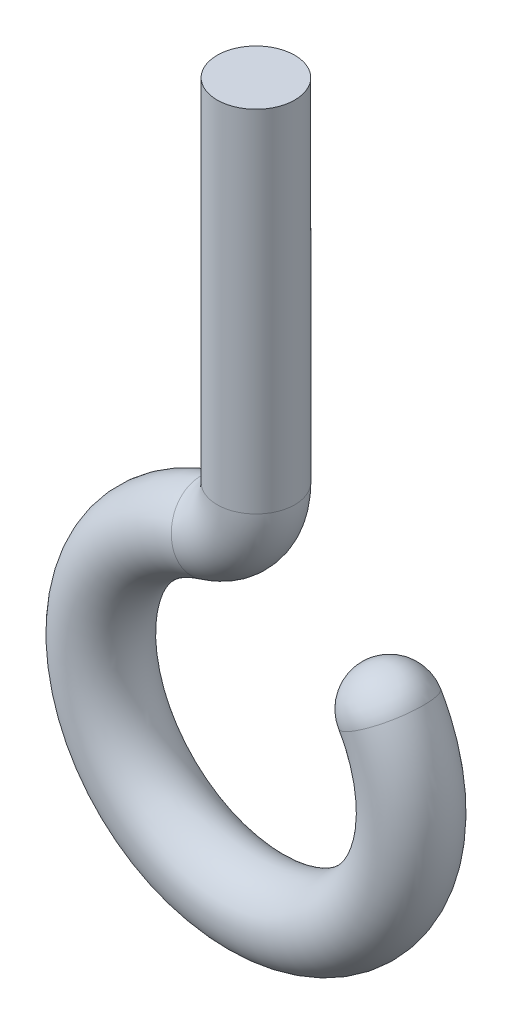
ISO-10303-21;
HEADER;
FILE_DESCRIPTION(('STEP AP214'),'2;1');
FILE_NAME('part.step','',(''),(''),'','','');
FILE_SCHEMA(('AUTOMOTIVE_DESIGN { 1 0 10303 214 1 1 1 1 }'));
ENDSEC;
DATA;
#1=APPLICATION_CONTEXT('core data for automotive mechanical design processes');
#2=APPLICATION_PROTOCOL_DEFINITION('international standard','automotive_design',2000,#1);
#3=PRODUCT_CONTEXT('',#1,'mechanical');
#4=PRODUCT('Part','Part','',(#3));
#5=PRODUCT_RELATED_PRODUCT_CATEGORY('part','',(#4));
#6=PRODUCT_DEFINITION_FORMATION('','',#4);
#7=PRODUCT_DEFINITION_CONTEXT('part definition',#1,'design');
#8=PRODUCT_DEFINITION('design','',#6,#7);
#9=PRODUCT_DEFINITION_SHAPE('','',#8);
#10=(LENGTH_UNIT() NAMED_UNIT(*) SI_UNIT(.MILLI.,.METRE.));
#11=(NAMED_UNIT(*) PLANE_ANGLE_UNIT() SI_UNIT($,.RADIAN.));
#12=(NAMED_UNIT(*) SI_UNIT($,.STERADIAN.) SOLID_ANGLE_UNIT());
#13=UNCERTAINTY_MEASURE_WITH_UNIT(LENGTH_MEASURE(1.E-05),#10,'distance_accuracy_value','');
#14=(GEOMETRIC_REPRESENTATION_CONTEXT(3) GLOBAL_UNCERTAINTY_ASSIGNED_CONTEXT((#13)) GLOBAL_UNIT_ASSIGNED_CONTEXT((#10,
#11,#12)) REPRESENTATION_CONTEXT('',''));
#15=CARTESIAN_POINT('',(0.,0.,0.));
#16=DIRECTION('',(0.,0.,1.));
#17=DIRECTION('',(1.,0.,0.));
#18=AXIS2_PLACEMENT_3D('',#15,#16,#17);
#19=CARTESIAN_POINT('',(0.,-28.,0.));
#20=DIRECTION('',(0.,1.,0.));
#21=DIRECTION('',(-1.,0.,0.));
#22=AXIS2_PLACEMENT_3D('',#19,#20,#21);
#23=PLANE('',#22);
#24=CARTESIAN_POINT('',(0.,-28.,0.));
#25=DIRECTION('',(0.,1.,0.));
#26=DIRECTION('',(-1.,0.,0.));
#27=AXIS2_PLACEMENT_3D('',#24,#25,#26);
#28=CIRCLE('',#27,1.25);
#29=CARTESIAN_POINT('',(-1.25,-28.,0.));
#30=VERTEX_POINT('',#29);
#31=EDGE_CURVE('E49',#30,#30,#28,.T.);
#32=ORIENTED_EDGE('',*,*,#31,.T.);
#33=EDGE_LOOP('',(#32));
#34=FACE_BOUND('',#33,.T.);
#35=ADVANCED_FACE('F34',(#34),#23,.T.);
#36=CARTESIAN_POINT('',(0.,-28.,0.));
#37=DIRECTION('',(0.,-1.,0.));
#38=DIRECTION('',(1.,0.,0.));
#39=AXIS2_PLACEMENT_3D('',#36,#37,#38);
#40=CYLINDRICAL_SURFACE('',#39,1.25);
#41=CARTESIAN_POINT('',(0.,-39.2917960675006,0.));
#42=DIRECTION('',(0.,1.,0.));
#43=DIRECTION('',(-1.,0.,0.));
#44=AXIS2_PLACEMENT_3D('',#41,#42,#43);
#45=CIRCLE('',#44,1.25);
#46=CARTESIAN_POINT('',(1.25000000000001,-39.2917960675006,0.));
#47=VERTEX_POINT('',#46);
#48=EDGE_CURVE('E45',#47,#47,#45,.T.);
#49=ORIENTED_EDGE('',*,*,#48,.T.);
#50=EDGE_LOOP('',(#49));
#51=FACE_BOUND('',#50,.T.);
#52=ORIENTED_EDGE('',*,*,#31,.F.);
#53=EDGE_LOOP('',(#52));
#54=FACE_BOUND('',#53,.T.);
#55=ADVANCED_FACE('F56',(#51,#54),#40,.T.);
#56=CARTESIAN_POINT('',(-2.,-39.2917960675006,0.));
#57=DIRECTION('',(0.,0.,-1.));
#58=DIRECTION('',(-1.,0.,0.));
#59=AXIS2_PLACEMENT_3D('',#56,#57,#58);
#60=TOROIDAL_SURFACE('',#59,2.00000000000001,1.25);
#61=CARTESIAN_POINT('',(-1.42857142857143,-41.2084257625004,0.));
#62=DIRECTION('',(0.95831484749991,0.285714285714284,0.));
#63=DIRECTION('',(-0.285714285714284,0.95831484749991,0.));
#64=AXIS2_PLACEMENT_3D('',#61,#62,#63);
#65=CIRCLE('',#64,1.25);
#66=CARTESIAN_POINT('',(-1.07142857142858,-42.4063193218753,0.));
#67=VERTEX_POINT('',#66);
#68=EDGE_CURVE('E41',#67,#67,#65,.T.);
#69=CARTESIAN_POINT('',(-2.,-39.2917960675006,0.));
#70=DIRECTION('',(0.,0.,-1.));
#71=DIRECTION('',(-1.,0.,0.));
#72=AXIS2_PLACEMENT_3D('',#69,#70,#71);
#73=CIRCLE('',#72,3.25000000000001);
#74=EDGE_CURVE('',#47,#67,#73,.T.);
#75=ORIENTED_EDGE('',*,*,#48,.F.);
#76=ORIENTED_EDGE('',*,*,#68,.T.);
#77=ORIENTED_EDGE('',*,*,#74,.T.);
#78=ORIENTED_EDGE('',*,*,#74,.F.);
#79=EDGE_LOOP('',(#75,#77,#76,#78));
#80=FACE_BOUND('',#79,.T.);
#81=ADVANCED_FACE('F58',(#80),#60,.T.);
#82=CARTESIAN_POINT('',(0.,-46.,0.));
#83=DIRECTION('',(0.,0.,1.));
#84=DIRECTION('',(1.,0.,0.));
#85=AXIS2_PLACEMENT_3D('',#82,#83,#84);
#86=TOROIDAL_SURFACE('',#85,5.,1.25);
#87=CARTESIAN_POINT('',(4.30714946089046,-43.4606174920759,0.));
#88=DIRECTION('',(-0.507876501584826,0.861429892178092,0.));
#89=DIRECTION('',(-0.861429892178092,-0.507876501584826,0.));
#90=AXIS2_PLACEMENT_3D('',#87,#88,#89);
#91=CIRCLE('',#90,1.25);
#92=CARTESIAN_POINT('',(3.23036209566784,-44.0954631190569,0.));
#93=VERTEX_POINT('',#92);
#94=EDGE_CURVE('E10',#93,#93,#91,.F.);
#95=ORIENTED_EDGE('',*,*,#94,.T.);
#96=EDGE_LOOP('',(#95));
#97=FACE_BOUND('',#96,.T.);
#98=ORIENTED_EDGE('',*,*,#68,.F.);
#99=EDGE_LOOP('',(#98));
#100=FACE_BOUND('',#99,.T.);
#101=ADVANCED_FACE('F65',(#97,#100),#86,.T.);
#102=CARTESIAN_POINT('',(4.30714946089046,-43.4606174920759,0.));
#103=DIRECTION('',(0.707106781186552,-0.707106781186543,0.));
#104=DIRECTION('',(0.707106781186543,0.707106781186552,0.));
#105=AXIS2_PLACEMENT_3D('',#102,#103,#104);
#106=SPHERICAL_SURFACE('',#105,1.25);
#107=CARTESIAN_POINT('',(4.30714946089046,-43.4606174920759,0.));
#108=DIRECTION('',(-0.507876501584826,0.861429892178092,0.));
#109=DIRECTION('',(-0.861429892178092,-0.507876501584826,0.));
#110=AXIS2_PLACEMENT_3D('',#107,#108,#109);
#111=SPHERICAL_SURFACE('',#110,1.25);
#112=ORIENTED_EDGE('',*,*,#94,.F.);
#113=EDGE_LOOP('',(#112));
#114=FACE_BOUND('',#113,.T.);
#115=ADVANCED_FACE('F36',(#114),#111,.T.);
#116=CLOSED_SHELL('',(#35,#55,#81,#101,#115));
#117=MANIFOLD_SOLID_BREP('B2',#116);
#118=ADVANCED_BREP_SHAPE_REPRESENTATION('',(#18,#117),#14);
#119=SHAPE_DEFINITION_REPRESENTATION(#9,#118);
ENDSEC;
END-ISO-10303-21;
